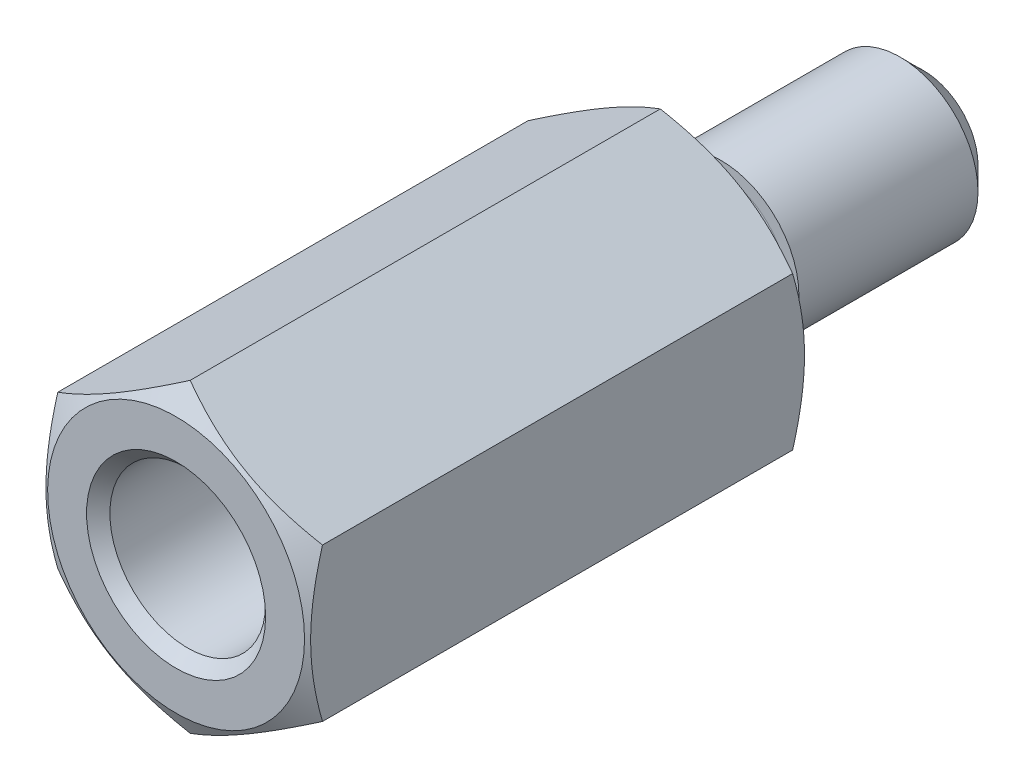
ISO-10303-21;
HEADER;
FILE_DESCRIPTION(('STEP AP214'),'2;1');
FILE_NAME('part.step','',(''),(''),'','','');
FILE_SCHEMA(('AUTOMOTIVE_DESIGN { 1 0 10303 214 1 1 1 1 }'));
ENDSEC;
DATA;
#1=APPLICATION_CONTEXT('core data for automotive mechanical design processes');
#2=APPLICATION_PROTOCOL_DEFINITION('international standard','automotive_design',2000,#1);
#3=PRODUCT_CONTEXT('',#1,'mechanical');
#4=PRODUCT('Part','Part','',(#3));
#5=PRODUCT_RELATED_PRODUCT_CATEGORY('part','',(#4));
#6=PRODUCT_DEFINITION_FORMATION('','',#4);
#7=PRODUCT_DEFINITION_CONTEXT('part definition',#1,'design');
#8=PRODUCT_DEFINITION('design','',#6,#7);
#9=PRODUCT_DEFINITION_SHAPE('','',#8);
#10=(LENGTH_UNIT() NAMED_UNIT(*) SI_UNIT(.MILLI.,.METRE.));
#11=(NAMED_UNIT(*) PLANE_ANGLE_UNIT() SI_UNIT($,.RADIAN.));
#12=(NAMED_UNIT(*) SI_UNIT($,.STERADIAN.) SOLID_ANGLE_UNIT());
#13=UNCERTAINTY_MEASURE_WITH_UNIT(LENGTH_MEASURE(1.E-05),#10,'distance_accuracy_value','');
#14=(GEOMETRIC_REPRESENTATION_CONTEXT(3) GLOBAL_UNCERTAINTY_ASSIGNED_CONTEXT((#13)) GLOBAL_UNIT_ASSIGNED_CONTEXT((#10,
#11,#12)) REPRESENTATION_CONTEXT('',''));
#15=CARTESIAN_POINT('',(0.,0.,0.));
#16=DIRECTION('',(0.,0.,1.));
#17=DIRECTION('',(1.,0.,0.));
#18=AXIS2_PLACEMENT_3D('',#15,#16,#17);
#19=CARTESIAN_POINT('',(8.5,4.90747728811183,0.));
#20=DIRECTION('',(0.,0.,-1.));
#21=DIRECTION('',(-1.,0.,0.));
#22=AXIS2_PLACEMENT_3D('',#19,#20,#21);
#23=PLANE('',#22);
#24=CARTESIAN_POINT('',(0.,0.,0.));
#25=DIRECTION('',(0.,0.,-1.));
#26=DIRECTION('',(-1.,0.,0.));
#27=AXIS2_PLACEMENT_3D('',#24,#25,#26);
#28=CIRCLE('',#27,4.25);
#29=CARTESIAN_POINT('',(-4.25,0.,0.));
#30=VERTEX_POINT('',#29);
#31=EDGE_CURVE('E9',#30,#30,#28,.F.);
#32=ORIENTED_EDGE('',*,*,#31,.T.);
#33=EDGE_LOOP('',(#32));
#34=FACE_BOUND('',#33,.T.);
#35=CARTESIAN_POINT('',(0.,0.,0.));
#36=DIRECTION('',(0.,0.,1.));
#37=DIRECTION('',(1.,0.,0.));
#38=AXIS2_PLACEMENT_3D('',#35,#36,#37);
#39=CIRCLE('',#38,8.25);
#40=CARTESIAN_POINT('',(8.25,0.,0.));
#41=VERTEX_POINT('',#40);
#42=EDGE_CURVE('E136',#41,#41,#39,.T.);
#43=ORIENTED_EDGE('',*,*,#42,.F.);
#44=EDGE_LOOP('',(#43));
#45=FACE_BOUND('',#44,.T.);
#46=ADVANCED_FACE('F14',(#34,#45),#23,.T.);
#47=CARTESIAN_POINT('',(0.,0.,42.756485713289));
#48=DIRECTION('',(0.,0.,1.));
#49=DIRECTION('',(1.,0.,0.));
#50=AXIS2_PLACEMENT_3D('',#47,#48,#49);
#51=CYLINDRICAL_SURFACE('',#50,3.85);
#52=CARTESIAN_POINT('',(0.,0.,-2.6));
#53=DIRECTION('',(0.,0.,-1.));
#54=DIRECTION('',(-1.,0.,0.));
#55=AXIS2_PLACEMENT_3D('',#52,#53,#54);
#56=CIRCLE('',#55,3.85);
#57=CARTESIAN_POINT('',(-3.85,0.,-2.6));
#58=VERTEX_POINT('',#57);
#59=EDGE_CURVE('E103',#58,#58,#56,.F.);
#60=ORIENTED_EDGE('',*,*,#59,.T.);
#61=EDGE_LOOP('',(#60));
#62=FACE_BOUND('',#61,.T.);
#63=CARTESIAN_POINT('',(0.,0.,-0.4));
#64=DIRECTION('',(0.,0.,-1.));
#65=DIRECTION('',(-1.,0.,0.));
#66=AXIS2_PLACEMENT_3D('',#63,#64,#65);
#67=CIRCLE('',#66,3.85);
#68=CARTESIAN_POINT('',(-3.85,0.,-0.4));
#69=VERTEX_POINT('',#68);
#70=EDGE_CURVE('E100',#69,#69,#67,.T.);
#71=ORIENTED_EDGE('',*,*,#70,.T.);
#72=EDGE_LOOP('',(#71));
#73=FACE_BOUND('',#72,.T.);
#74=ADVANCED_FACE('F120',(#62,#73),#51,.T.);
#75=CARTESIAN_POINT('',(0.,3.85,-3.));
#76=DIRECTION('',(0.,0.,-1.));
#77=DIRECTION('',(-1.,0.,0.));
#78=AXIS2_PLACEMENT_3D('',#75,#76,#77);
#79=PLANE('',#78);
#80=CARTESIAN_POINT('',(0.,0.,-3.));
#81=DIRECTION('',(0.,0.,-1.));
#82=DIRECTION('',(-1.,0.,0.));
#83=AXIS2_PLACEMENT_3D('',#80,#81,#82);
#84=CIRCLE('',#83,4.25);
#85=CARTESIAN_POINT('',(-4.25,0.,-3.));
#86=VERTEX_POINT('',#85);
#87=EDGE_CURVE('E24',#86,#86,#84,.T.);
#88=ORIENTED_EDGE('',*,*,#87,.T.);
#89=EDGE_LOOP('',(#88));
#90=FACE_BOUND('',#89,.T.);
#91=CARTESIAN_POINT('',(0.,0.,-3.));
#92=DIRECTION('',(0.,0.,1.));
#93=DIRECTION('',(1.,0.,0.));
#94=AXIS2_PLACEMENT_3D('',#91,#92,#93);
#95=CIRCLE('',#94,5.);
#96=CARTESIAN_POINT('',(5.,0.,-3.));
#97=VERTEX_POINT('',#96);
#98=EDGE_CURVE('E269',#97,#97,#95,.T.);
#99=ORIENTED_EDGE('',*,*,#98,.T.);
#100=EDGE_LOOP('',(#99));
#101=FACE_BOUND('',#100,.T.);
#102=ADVANCED_FACE('F109',(#90,#101),#79,.F.);
#103=CARTESIAN_POINT('',(0.,0.,42.756485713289));
#104=DIRECTION('',(0.,0.,1.));
#105=DIRECTION('',(1.,0.,0.));
#106=AXIS2_PLACEMENT_3D('',#103,#104,#105);
#107=CYLINDRICAL_SURFACE('',#106,5.);
#108=CARTESIAN_POINT('',(0.,0.,-14.5));
#109=DIRECTION('',(0.,0.,1.));
#110=DIRECTION('',(1.,0.,0.));
#111=AXIS2_PLACEMENT_3D('',#108,#109,#110);
#112=CIRCLE('',#111,5.);
#113=CARTESIAN_POINT('',(5.,0.,-14.5));
#114=VERTEX_POINT('',#113);
#115=EDGE_CURVE('E88',#114,#114,#112,.T.);
#116=ORIENTED_EDGE('',*,*,#115,.T.);
#117=EDGE_LOOP('',(#116));
#118=FACE_BOUND('',#117,.T.);
#119=ORIENTED_EDGE('',*,*,#98,.F.);
#120=EDGE_LOOP('',(#119));
#121=FACE_BOUND('',#120,.T.);
#122=ADVANCED_FACE('F392',(#118,#121),#107,.T.);
#123=CARTESIAN_POINT('',(0.,5.,-16.));
#124=DIRECTION('',(0.,0.,1.));
#125=DIRECTION('',(1.,0.,0.));
#126=AXIS2_PLACEMENT_3D('',#123,#124,#125);
#127=PLANE('',#126);
#128=CARTESIAN_POINT('',(0.,0.,-16.));
#129=DIRECTION('',(0.,0.,1.));
#130=DIRECTION('',(1.,0.,0.));
#131=AXIS2_PLACEMENT_3D('',#128,#129,#130);
#132=CIRCLE('',#131,3.5);
#133=CARTESIAN_POINT('',(3.5,0.,-16.));
#134=VERTEX_POINT('',#133);
#135=EDGE_CURVE('E92',#134,#134,#132,.F.);
#136=ORIENTED_EDGE('',*,*,#135,.T.);
#137=EDGE_LOOP('',(#136));
#138=FACE_BOUND('',#137,.T.);
#139=ADVANCED_FACE('F382',(#138),#127,.F.);
#140=CARTESIAN_POINT('',(0.,0.,-14.5));
#141=DIRECTION('',(0.,0.,1.));
#142=DIRECTION('',(1.,0.,0.));
#143=AXIS2_PLACEMENT_3D('',#140,#141,#142);
#144=CONICAL_SURFACE('',#143,5.,0.785398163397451);
#145=ORIENTED_EDGE('',*,*,#135,.F.);
#146=EDGE_LOOP('',(#145));
#147=FACE_BOUND('',#146,.T.);
#148=ORIENTED_EDGE('',*,*,#115,.F.);
#149=EDGE_LOOP('',(#148));
#150=FACE_BOUND('',#149,.T.);
#151=ADVANCED_FACE('F116',(#147,#150),#144,.T.);
#152=CARTESIAN_POINT('',(0.,0.,-2.6));
#153=DIRECTION('',(0.,0.,-1.));
#154=DIRECTION('',(-1.,0.,0.));
#155=AXIS2_PLACEMENT_3D('',#152,#153,#154);
#156=TOROIDAL_SURFACE('',#155,4.25,0.4);
#157=ORIENTED_EDGE('',*,*,#87,.F.);
#158=EDGE_LOOP('',(#157));
#159=FACE_BOUND('',#158,.T.);
#160=ORIENTED_EDGE('',*,*,#59,.F.);
#161=EDGE_LOOP('',(#160));
#162=FACE_BOUND('',#161,.T.);
#163=ADVANCED_FACE('F112',(#159,#162),#156,.F.);
#164=CARTESIAN_POINT('',(0.,0.,-0.4));
#165=DIRECTION('',(0.,0.,-1.));
#166=DIRECTION('',(-1.,0.,0.));
#167=AXIS2_PLACEMENT_3D('',#164,#165,#166);
#168=TOROIDAL_SURFACE('',#167,4.25,0.4);
#169=ORIENTED_EDGE('',*,*,#70,.F.);
#170=EDGE_LOOP('',(#169));
#171=FACE_BOUND('',#170,.T.);
#172=ORIENTED_EDGE('',*,*,#31,.F.);
#173=EDGE_LOOP('',(#172));
#174=FACE_BOUND('',#173,.T.);
#175=ADVANCED_FACE('F115',(#171,#174),#168,.F.);
#176=CARTESIAN_POINT('',(0.,0.,0.903526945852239));
#177=DIRECTION('',(0.,0.,1.));
#178=DIRECTION('',(1.,0.,0.));
#179=AXIS2_PLACEMENT_3D('',#176,#177,#178);
#180=CONICAL_SURFACE('',#179,9.81495457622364,1.04719755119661);
#181=ORIENTED_EDGE('',*,*,#42,.T.);
#182=EDGE_LOOP('',(#181));
#183=FACE_BOUND('',#182,.T.);
#184=CARTESIAN_POINT('',(-0.000199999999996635,9.81507004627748,0.903593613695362));
#185=CARTESIAN_POINT('',(0.186639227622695,9.70719836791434,0.841323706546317));
#186=CARTESIAN_POINT('',(0.374175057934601,9.59892450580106,0.781879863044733));
#187=CARTESIAN_POINT('',(0.750769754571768,9.38149745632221,0.669422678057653));
#188=CARTESIAN_POINT('',(0.939829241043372,9.27234391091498,0.616412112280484));
#189=CARTESIAN_POINT('',(1.5100347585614,8.94313560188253,0.468070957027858));
#190=CARTESIAN_POINT('',(1.89343164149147,8.72178130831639,0.383696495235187));
#191=CARTESIAN_POINT('',(2.46717766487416,8.39052888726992,0.284757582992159));
#192=CARTESIAN_POINT('',(2.65581276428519,8.28162036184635,0.256572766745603));
#193=CARTESIAN_POINT('',(3.03393602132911,8.06331079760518,0.209311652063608));
#194=CARTESIAN_POINT('',(3.22342410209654,7.95390980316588,0.190234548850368));
#195=CARTESIAN_POINT('',(3.6027265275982,7.73491944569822,0.161672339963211));
#196=CARTESIAN_POINT('',(3.79254025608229,7.62533043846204,0.15217634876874));
#197=CARTESIAN_POINT('',(4.17234305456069,7.40605119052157,0.142979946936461));
#198=CARTESIAN_POINT('',(4.36233211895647,7.29636095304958,0.143279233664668));
#199=CARTESIAN_POINT('',(4.71752301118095,7.09129139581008,0.152992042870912));
#200=CARTESIAN_POINT('',(4.8827499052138,6.99589760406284,0.161220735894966));
#201=CARTESIAN_POINT('',(5.21281671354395,6.80533344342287,0.184926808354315));
#202=CARTESIAN_POINT('',(5.37765660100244,6.71016309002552,0.200404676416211));
#203=CARTESIAN_POINT('',(5.87153810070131,6.4250204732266,0.257346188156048));
#204=CARTESIAN_POINT('',(6.19970550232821,6.23555293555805,0.309310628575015));
#205=CARTESIAN_POINT('',(6.85952142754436,5.85460803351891,0.439222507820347));
#206=CARTESIAN_POINT('',(7.19108574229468,5.66317928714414,0.51772063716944));
#207=CARTESIAN_POINT('',(7.84926989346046,5.28317649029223,0.695878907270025));
#208=CARTESIAN_POINT('',(8.17589815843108,5.0945975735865,0.79549720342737));
#209=CARTESIAN_POINT('',(8.5002,4.90736181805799,0.903593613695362));
#210=B_SPLINE_CURVE_WITH_KNOTS('',3,(#184,#185,#186,#187,#188,#189,#190,#191,#192,#193,#194,
#195,#196,#197,#198,#199,#200,#201,#202,#203,#204,#205,#206,#207,#208,#209),.UNSPECIFIED.,.F.,
.F.,(4,2,2,2,2,2,2,2,2,2,2,2,4),(0.,0.673596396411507,1.34748239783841,2.69805431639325,
3.35679995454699,4.01548737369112,4.67342558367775,5.33134346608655,5.90409556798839,
6.47688628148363,7.62328361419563,8.79510569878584,9.96462743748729),.UNSPECIFIED.);
#211=CARTESIAN_POINT('',(0.,9.81495457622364,0.903526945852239));
#212=VERTEX_POINT('',#211);
#213=CARTESIAN_POINT('',(8.5,4.90747728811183,0.903526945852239));
#214=VERTEX_POINT('',#213);
#215=EDGE_CURVE('E31',#212,#214,#210,.T.);
#216=ORIENTED_EDGE('',*,*,#215,.T.);
#217=CARTESIAN_POINT('',(8.5,-12.9953438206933,4.20214445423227));
#218=CARTESIAN_POINT('',(8.5,-12.6223011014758,4.02195280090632));
#219=CARTESIAN_POINT('',(8.5,-12.2483741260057,3.84355854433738));
#220=CARTESIAN_POINT('',(8.5,-11.4982734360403,3.49139239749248));
#221=CARTESIAN_POINT('',(8.5,-11.1220993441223,3.31762131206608));
#222=CARTESIAN_POINT('',(8.5,-10.3649842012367,2.97480925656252));
#223=CARTESIAN_POINT('',(8.5,-9.9840281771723,2.80580123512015));
#224=CARTESIAN_POINT('',(8.5,-9.2189776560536,2.47507337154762));
#225=CARTESIAN_POINT('',(8.5,-8.83488332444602,2.31335314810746));
#226=CARTESIAN_POINT('',(8.5,-8.05827000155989,1.99725792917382));
#227=CARTESIAN_POINT('',(8.5,-7.66570525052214,1.84299473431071));
#228=CARTESIAN_POINT('',(8.5,-6.87593938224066,1.54660014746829));
#229=CARTESIAN_POINT('',(8.5,-6.47873775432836,1.40447010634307));
#230=CARTESIAN_POINT('',(8.5,-5.67988381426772,1.13617601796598));
#231=CARTESIAN_POINT('',(8.5,-5.27824308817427,1.00997785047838));
#232=CARTESIAN_POINT('',(8.5,-4.46926711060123,0.777656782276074));
#233=CARTESIAN_POINT('',(8.5,-4.06193370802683,0.671527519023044));
#234=CARTESIAN_POINT('',(8.5,-3.24121808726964,0.484515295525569));
#235=CARTESIAN_POINT('',(8.5,-2.82783404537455,0.403640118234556));
#236=CARTESIAN_POINT('',(8.5,-2.20413783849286,0.305328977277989));
#237=CARTESIAN_POINT('',(8.5,-1.99561028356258,0.276390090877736));
#238=CARTESIAN_POINT('',(8.5,-1.57758365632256,0.226749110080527));
#239=CARTESIAN_POINT('',(8.5,-1.36808467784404,0.206046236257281));
#240=CARTESIAN_POINT('',(8.5,-0.949716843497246,0.173433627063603));
#241=CARTESIAN_POINT('',(8.5,-0.740852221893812,0.16146979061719));
#242=CARTESIAN_POINT('',(8.5,-0.32280433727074,0.146398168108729));
#243=CARTESIAN_POINT('',(8.5,-0.113621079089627,0.143290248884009));
#244=CARTESIAN_POINT('',(8.5,0.304629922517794,0.146004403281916));
#245=CARTESIAN_POINT('',(8.5,0.513697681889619,0.151823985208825));
#246=CARTESIAN_POINT('',(8.5,0.931406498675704,0.172248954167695));
#247=CARTESIAN_POINT('',(8.5,1.14004753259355,0.186854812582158));
#248=CARTESIAN_POINT('',(8.5,1.64621912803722,0.232643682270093));
#249=CARTESIAN_POINT('',(8.5,1.94335676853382,0.268255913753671));
#250=CARTESIAN_POINT('',(8.5,2.53529083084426,0.355313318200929));
#251=CARTESIAN_POINT('',(8.5,2.83008689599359,0.40676085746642));
#252=CARTESIAN_POINT('',(8.5,3.71148367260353,0.582274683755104));
#253=CARTESIAN_POINT('',(8.5,4.29393978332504,0.727394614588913));
#254=CARTESIAN_POINT('',(8.5,5.16515755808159,0.977457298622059));
#255=CARTESIAN_POINT('',(8.5,5.45847541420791,1.06742556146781));
#256=CARTESIAN_POINT('',(8.5,6.04227759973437,1.25629246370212));
#257=CARTESIAN_POINT('',(8.5,6.33276167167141,1.3551919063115));
#258=CARTESIAN_POINT('',(8.5,6.90944623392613,1.55980497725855));
#259=CARTESIAN_POINT('',(8.5,7.19566165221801,1.66547695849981));
#260=CARTESIAN_POINT('',(8.5,7.76565926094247,1.88291533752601));
#261=CARTESIAN_POINT('',(8.5,8.04944225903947,1.99467961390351));
#262=CARTESIAN_POINT('',(8.5,8.33220149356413,2.10891920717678));
#263=B_SPLINE_CURVE_WITH_KNOTS('',3,(#217,#218,#219,#220,#221,#222,#223,#224,#225,#226,#227,
#228,#229,#230,#231,#232,#233,#234,#235,#236,#237,#238,#239,#240,#241,#242,#243,#244,#245,#246,
#247,#248,#249,#250,#251,#252,#253,#254,#255,#256,#257,#258,#259,#260,#261,#262),.UNSPECIFIED.,
.F.,.F.,(4,2,2,2,2,2,2,2,2,2,2,2,2,2,2,2,2,2,2,2,2,2,4),(0.,1.24286396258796,2.48594289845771,
3.73617049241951,4.98633259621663,6.25153784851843,7.51688378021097,8.77947209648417,
10.0416594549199,11.3042354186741,11.93567629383,12.5670573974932,13.1944958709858,
13.8219249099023,14.4491788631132,15.0764664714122,15.9737486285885,16.8711649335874,
18.6694595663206,19.5898052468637,20.5102337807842,21.4254630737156,22.3403756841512),.UNSPECIFIED.);
#264=CARTESIAN_POINT('',(8.5,-4.90747728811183,0.903526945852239));
#265=VERTEX_POINT('',#264);
#266=EDGE_CURVE('E138',#214,#265,#263,.F.);
#267=ORIENTED_EDGE('',*,*,#266,.T.);
#268=CARTESIAN_POINT('',(8.5002,-4.90736181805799,0.90359361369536));
#269=CARTESIAN_POINT('',(8.31336077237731,-5.01523349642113,0.841323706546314));
#270=CARTESIAN_POINT('',(8.1258249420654,-5.12350735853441,0.781879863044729));
#271=CARTESIAN_POINT('',(7.74923024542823,-5.34093440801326,0.669422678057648));
#272=CARTESIAN_POINT('',(7.56017075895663,-5.45008795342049,0.616412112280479));
#273=CARTESIAN_POINT('',(6.9899652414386,-5.77929626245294,0.468070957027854));
#274=CARTESIAN_POINT('',(6.60656835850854,-6.00065055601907,0.383696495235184));
#275=CARTESIAN_POINT('',(6.03282233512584,-6.33190297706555,0.284757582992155));
#276=CARTESIAN_POINT('',(5.84418723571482,-6.44081150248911,0.256572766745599));
#277=CARTESIAN_POINT('',(5.46606397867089,-6.65912106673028,0.209311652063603));
#278=CARTESIAN_POINT('',(5.27657589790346,-6.76852206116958,0.190234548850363));
#279=CARTESIAN_POINT('',(4.8972734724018,-6.98751241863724,0.161672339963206));
#280=CARTESIAN_POINT('',(4.70745974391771,-7.09710142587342,0.152176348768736));
#281=CARTESIAN_POINT('',(4.32765694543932,-7.31638067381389,0.142979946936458));
#282=CARTESIAN_POINT('',(4.13766788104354,-7.42607091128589,0.143279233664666));
#283=CARTESIAN_POINT('',(3.78247698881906,-7.63114046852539,0.15299204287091));
#284=CARTESIAN_POINT('',(3.61725009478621,-7.72653426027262,0.161220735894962));
#285=CARTESIAN_POINT('',(3.28718328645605,-7.9170984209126,0.184926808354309));
#286=CARTESIAN_POINT('',(3.12234339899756,-8.01226877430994,0.200404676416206));
#287=CARTESIAN_POINT('',(2.62846189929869,-8.29741139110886,0.257346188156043));
#288=CARTESIAN_POINT('',(2.30029449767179,-8.48687892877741,0.309310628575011));
#289=CARTESIAN_POINT('',(1.64047857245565,-8.86782383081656,0.439222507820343));
#290=CARTESIAN_POINT('',(1.30891425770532,-9.05925257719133,0.517720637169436));
#291=CARTESIAN_POINT('',(0.650730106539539,-9.43925537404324,0.695878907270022));
#292=CARTESIAN_POINT('',(0.324101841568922,-9.62783429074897,0.795497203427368));
#293=CARTESIAN_POINT('',(-0.000199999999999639,-9.81507004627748,0.90359361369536));
#294=B_SPLINE_CURVE_WITH_KNOTS('',3,(#268,#269,#270,#271,#272,#273,#274,#275,#276,#277,#278,
#279,#280,#281,#282,#283,#284,#285,#286,#287,#288,#289,#290,#291,#292,#293),.UNSPECIFIED.,.F.,
.F.,(4,2,2,2,2,2,2,2,2,2,2,2,4),(0.,0.673596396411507,1.34748239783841,2.69805431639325,
3.35679995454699,4.01548737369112,4.67342558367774,5.33134346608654,5.90409556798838,
6.47688628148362,7.62328361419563,8.79510569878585,9.96462743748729),.UNSPECIFIED.);
#295=CARTESIAN_POINT('',(0.,-9.81495457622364,0.903526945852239));
#296=VERTEX_POINT('',#295);
#297=EDGE_CURVE('E140',#265,#296,#294,.T.);
#298=ORIENTED_EDGE('',*,*,#297,.T.);
#299=CARTESIAN_POINT('',(0.00019999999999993,-9.81507004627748,0.90359361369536));
#300=CARTESIAN_POINT('',(-0.186639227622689,-9.70719836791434,0.841323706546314));
#301=CARTESIAN_POINT('',(-0.374175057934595,-9.59892450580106,0.78187986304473));
#302=CARTESIAN_POINT('',(-0.75076975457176,-9.3814974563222,0.669422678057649));
#303=CARTESIAN_POINT('',(-0.939829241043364,-9.27234391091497,0.61641211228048));
#304=CARTESIAN_POINT('',(-1.51003475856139,-8.94313560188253,0.468070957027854));
#305=CARTESIAN_POINT('',(-1.89343164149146,-8.72178130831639,0.383696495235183));
#306=CARTESIAN_POINT('',(-2.46717766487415,-8.39052888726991,0.284757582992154));
#307=CARTESIAN_POINT('',(-2.65581276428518,-8.28162036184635,0.256572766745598));
#308=CARTESIAN_POINT('',(-3.0339360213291,-8.06331079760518,0.209311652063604));
#309=CARTESIAN_POINT('',(-3.22342410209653,-7.95390980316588,0.190234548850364));
#310=CARTESIAN_POINT('',(-3.60272652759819,-7.73491944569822,0.161672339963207));
#311=CARTESIAN_POINT('',(-3.79254025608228,-7.62533043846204,0.152176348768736));
#312=CARTESIAN_POINT('',(-4.17234305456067,-7.40605119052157,0.142979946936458));
#313=CARTESIAN_POINT('',(-4.36233211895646,-7.29636095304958,0.143279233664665));
#314=CARTESIAN_POINT('',(-4.71752301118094,-7.09129139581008,0.152992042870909));
#315=CARTESIAN_POINT('',(-4.88274990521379,-6.99589760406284,0.161220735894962));
#316=CARTESIAN_POINT('',(-5.21281671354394,-6.80533344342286,0.184926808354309));
#317=CARTESIAN_POINT('',(-5.37765660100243,-6.71016309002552,0.200404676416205));
#318=CARTESIAN_POINT('',(-5.8715381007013,-6.4250204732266,0.257346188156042));
#319=CARTESIAN_POINT('',(-6.1997055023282,-6.23555293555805,0.30931062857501));
#320=CARTESIAN_POINT('',(-6.85952142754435,-5.8546080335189,0.439222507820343));
#321=CARTESIAN_POINT('',(-7.19108574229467,-5.66317928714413,0.517720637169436));
#322=CARTESIAN_POINT('',(-7.84926989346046,-5.28317649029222,0.695878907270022));
#323=CARTESIAN_POINT('',(-8.17589815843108,-5.09459757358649,0.795497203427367));
#324=CARTESIAN_POINT('',(-8.5002,-4.90736181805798,0.90359361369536));
#325=B_SPLINE_CURVE_WITH_KNOTS('',3,(#299,#300,#301,#302,#303,#304,#305,#306,#307,#308,#309,
#310,#311,#312,#313,#314,#315,#316,#317,#318,#319,#320,#321,#322,#323,#324),.UNSPECIFIED.,.F.,
.F.,(4,2,2,2,2,2,2,2,2,2,2,2,4),(0.,0.673596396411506,1.34748239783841,2.69805431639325,
3.35679995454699,4.01548737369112,4.67342558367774,5.33134346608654,5.90409556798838,
6.47688628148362,7.62328361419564,8.79510569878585,9.9646274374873),.UNSPECIFIED.);
#326=CARTESIAN_POINT('',(-8.5,-4.90747728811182,0.903526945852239));
#327=VERTEX_POINT('',#326);
#328=EDGE_CURVE('E237',#296,#327,#325,.T.);
#329=ORIENTED_EDGE('',*,*,#328,.T.);
#330=CARTESIAN_POINT('',(-8.5,-12.9953438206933,4.20214445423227));
#331=CARTESIAN_POINT('',(-8.5,-12.6223011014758,4.02195280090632));
#332=CARTESIAN_POINT('',(-8.5,-12.2483741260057,3.84355854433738));
#333=CARTESIAN_POINT('',(-8.5,-11.4982734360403,3.49139239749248));
#334=CARTESIAN_POINT('',(-8.5,-11.1220993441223,3.31762131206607));
#335=CARTESIAN_POINT('',(-8.5,-10.3649842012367,2.97480925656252));
#336=CARTESIAN_POINT('',(-8.5,-9.98402817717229,2.80580123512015));
#337=CARTESIAN_POINT('',(-8.5,-9.21897765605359,2.47507337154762));
#338=CARTESIAN_POINT('',(-8.5,-8.83488332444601,2.31335314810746));
#339=CARTESIAN_POINT('',(-8.5,-8.05827000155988,1.99725792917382));
#340=CARTESIAN_POINT('',(-8.5,-7.66570525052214,1.8429947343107));
#341=CARTESIAN_POINT('',(-8.5,-6.87593938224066,1.54660014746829));
#342=CARTESIAN_POINT('',(-8.5,-6.47873775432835,1.40447010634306));
#343=CARTESIAN_POINT('',(-8.5,-5.67988381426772,1.13617601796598));
#344=CARTESIAN_POINT('',(-8.5,-5.27824308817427,1.00997785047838));
#345=CARTESIAN_POINT('',(-8.5,-4.46926711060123,0.777656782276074));
#346=CARTESIAN_POINT('',(-8.5,-4.06193370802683,0.671527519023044));
#347=CARTESIAN_POINT('',(-8.5,-3.24121808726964,0.48451529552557));
#348=CARTESIAN_POINT('',(-8.5,-2.82783404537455,0.403640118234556));
#349=CARTESIAN_POINT('',(-8.5,-2.20413783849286,0.305328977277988));
#350=CARTESIAN_POINT('',(-8.5,-1.99561028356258,0.276390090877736));
#351=CARTESIAN_POINT('',(-8.5,-1.57758365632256,0.226749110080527));
#352=CARTESIAN_POINT('',(-8.5,-1.36808467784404,0.206046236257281));
#353=CARTESIAN_POINT('',(-8.5,-0.949716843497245,0.173433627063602));
#354=CARTESIAN_POINT('',(-8.5,-0.74085222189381,0.16146979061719));
#355=CARTESIAN_POINT('',(-8.5,-0.322804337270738,0.146398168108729));
#356=CARTESIAN_POINT('',(-8.5,-0.113621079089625,0.143290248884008));
#357=CARTESIAN_POINT('',(-8.5,0.304629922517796,0.146004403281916));
#358=CARTESIAN_POINT('',(-8.5,0.513697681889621,0.151823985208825));
#359=CARTESIAN_POINT('',(-8.5,0.931406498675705,0.172248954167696));
#360=CARTESIAN_POINT('',(-8.5,1.14004753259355,0.186854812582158));
#361=CARTESIAN_POINT('',(-8.5,1.64621912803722,0.232643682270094));
#362=CARTESIAN_POINT('',(-8.5,1.94335676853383,0.268255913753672));
#363=CARTESIAN_POINT('',(-8.5,2.53529083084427,0.355313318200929));
#364=CARTESIAN_POINT('',(-8.5,2.83008689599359,0.406760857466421));
#365=CARTESIAN_POINT('',(-8.5,3.71148367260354,0.582274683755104));
#366=CARTESIAN_POINT('',(-8.5,4.29393978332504,0.727394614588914));
#367=CARTESIAN_POINT('',(-8.5,5.1651575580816,0.977457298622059));
#368=CARTESIAN_POINT('',(-8.5,5.45847541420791,1.06742556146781));
#369=CARTESIAN_POINT('',(-8.5,6.04227759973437,1.25629246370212));
#370=CARTESIAN_POINT('',(-8.5,6.33276167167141,1.35519190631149));
#371=CARTESIAN_POINT('',(-8.5,6.90944623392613,1.55980497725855));
#372=CARTESIAN_POINT('',(-8.5,7.19566165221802,1.66547695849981));
#373=CARTESIAN_POINT('',(-8.5,7.76565926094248,1.88291533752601));
#374=CARTESIAN_POINT('',(-8.5,8.04944225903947,1.99467961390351));
#375=CARTESIAN_POINT('',(-8.5,8.33220149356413,2.10891920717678));
#376=B_SPLINE_CURVE_WITH_KNOTS('',3,(#330,#331,#332,#333,#334,#335,#336,#337,#338,#339,#340,
#341,#342,#343,#344,#345,#346,#347,#348,#349,#350,#351,#352,#353,#354,#355,#356,#357,#358,#359,
#360,#361,#362,#363,#364,#365,#366,#367,#368,#369,#370,#371,#372,#373,#374,#375),.UNSPECIFIED.,
.F.,.F.,(4,2,2,2,2,2,2,2,2,2,2,2,2,2,2,2,2,2,2,2,2,2,4),(0.,1.24286396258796,2.48594289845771,
3.73617049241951,4.98633259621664,6.25153784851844,7.51688378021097,8.77947209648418,
10.0416594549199,11.3042354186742,11.93567629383,12.5670573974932,13.1944958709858,
13.8219249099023,14.4491788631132,15.0764664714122,15.9737486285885,16.8711649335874,
18.6694595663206,19.5898052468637,20.5102337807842,21.4254630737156,22.3403756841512),.UNSPECIFIED.);
#377=CARTESIAN_POINT('',(-8.5,4.90747728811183,0.903526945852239));
#378=VERTEX_POINT('',#377);
#379=EDGE_CURVE('E70',#327,#378,#376,.T.);
#380=ORIENTED_EDGE('',*,*,#379,.T.);
#381=CARTESIAN_POINT('',(-8.5002,4.90736181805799,0.903593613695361));
#382=CARTESIAN_POINT('',(-8.31336077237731,5.01523349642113,0.841323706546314));
#383=CARTESIAN_POINT('',(-8.1258249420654,5.12350735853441,0.781879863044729));
#384=CARTESIAN_POINT('',(-7.74923024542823,5.34093440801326,0.669422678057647));
#385=CARTESIAN_POINT('',(-7.56017075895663,5.45008795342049,0.616412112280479));
#386=CARTESIAN_POINT('',(-6.9899652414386,5.77929626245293,0.468070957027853));
#387=CARTESIAN_POINT('',(-6.60656835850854,6.00065055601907,0.383696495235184));
#388=CARTESIAN_POINT('',(-6.03282233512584,6.33190297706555,0.284757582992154));
#389=CARTESIAN_POINT('',(-5.84418723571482,6.44081150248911,0.256572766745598));
#390=CARTESIAN_POINT('',(-5.46606397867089,6.65912106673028,0.209311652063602));
#391=CARTESIAN_POINT('',(-5.27657589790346,6.76852206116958,0.190234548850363));
#392=CARTESIAN_POINT('',(-4.8972734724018,6.98751241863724,0.161672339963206));
#393=CARTESIAN_POINT('',(-4.70745974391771,7.09710142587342,0.152176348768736));
#394=CARTESIAN_POINT('',(-4.32765694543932,7.31638067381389,0.142979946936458));
#395=CARTESIAN_POINT('',(-4.13766788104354,7.42607091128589,0.143279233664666));
#396=CARTESIAN_POINT('',(-3.78247698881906,7.63114046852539,0.15299204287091));
#397=CARTESIAN_POINT('',(-3.61725009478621,7.72653426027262,0.161220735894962));
#398=CARTESIAN_POINT('',(-3.28718328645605,7.91709842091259,0.184926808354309));
#399=CARTESIAN_POINT('',(-3.12234339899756,8.01226877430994,0.200404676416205));
#400=CARTESIAN_POINT('',(-2.62846189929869,8.29741139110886,0.257346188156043));
#401=CARTESIAN_POINT('',(-2.30029449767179,8.48687892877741,0.30931062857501));
#402=CARTESIAN_POINT('',(-1.64047857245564,8.86782383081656,0.439222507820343));
#403=CARTESIAN_POINT('',(-1.30891425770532,9.05925257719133,0.517720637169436));
#404=CARTESIAN_POINT('',(-0.650730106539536,9.43925537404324,0.695878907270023));
#405=CARTESIAN_POINT('',(-0.324101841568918,9.62783429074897,0.795497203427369));
#406=CARTESIAN_POINT('',(0.000200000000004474,9.81507004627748,0.903593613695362));
#407=B_SPLINE_CURVE_WITH_KNOTS('',3,(#381,#382,#383,#384,#385,#386,#387,#388,#389,#390,#391,
#392,#393,#394,#395,#396,#397,#398,#399,#400,#401,#402,#403,#404,#405,#406),.UNSPECIFIED.,.F.,
.F.,(4,2,2,2,2,2,2,2,2,2,2,2,4),(0.,0.673596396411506,1.34748239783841,2.69805431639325,
3.35679995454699,4.01548737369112,4.67342558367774,5.33134346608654,5.90409556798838,
6.47688628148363,7.62328361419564,8.79510569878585,9.9646274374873),.UNSPECIFIED.);
#408=EDGE_CURVE('E67',#378,#212,#407,.T.);
#409=ORIENTED_EDGE('',*,*,#408,.T.);
#410=EDGE_LOOP('',(#216,#267,#298,#329,#380,#409));
#411=FACE_BOUND('',#410,.T.);
#412=ADVANCED_FACE('F68',(#183,#411),#180,.T.);
#413=CARTESIAN_POINT('',(0.,0.,32.));
#414=DIRECTION('',(0.,0.,1.));
#415=DIRECTION('',(1.,0.,0.));
#416=AXIS2_PLACEMENT_3D('',#413,#414,#415);
#417=CONICAL_SURFACE('',#416,5.75,0.785398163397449);
#418=CARTESIAN_POINT('',(0.,0.,31.25));
#419=DIRECTION('',(0.,0.,1.));
#420=DIRECTION('',(1.,0.,0.));
#421=AXIS2_PLACEMENT_3D('',#418,#419,#420);
#422=CIRCLE('',#421,5.);
#423=CARTESIAN_POINT('',(5.,0.,31.25));
#424=VERTEX_POINT('',#423);
#425=EDGE_CURVE('E19',#424,#424,#422,.F.);
#426=ORIENTED_EDGE('',*,*,#425,.T.);
#427=EDGE_LOOP('',(#426));
#428=FACE_BOUND('',#427,.T.);
#429=CARTESIAN_POINT('',(0.,0.,32.));
#430=DIRECTION('',(0.,0.,1.));
#431=DIRECTION('',(1.,0.,0.));
#432=AXIS2_PLACEMENT_3D('',#429,#430,#431);
#433=CIRCLE('',#432,5.75);
#434=CARTESIAN_POINT('',(5.75,0.,32.));
#435=VERTEX_POINT('',#434);
#436=EDGE_CURVE('E271',#435,#435,#433,.T.);
#437=ORIENTED_EDGE('',*,*,#436,.T.);
#438=EDGE_LOOP('',(#437));
#439=FACE_BOUND('',#438,.T.);
#440=ADVANCED_FACE('F189',(#428,#439),#417,.F.);
#441=CARTESIAN_POINT('',(8.5,4.90747728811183,32.));
#442=DIRECTION('',(0.,0.,-1.));
#443=DIRECTION('',(-1.,0.,0.));
#444=AXIS2_PLACEMENT_3D('',#441,#442,#443);
#445=PLANE('',#444);
#446=ORIENTED_EDGE('',*,*,#436,.F.);
#447=EDGE_LOOP('',(#446));
#448=FACE_BOUND('',#447,.T.);
#449=CARTESIAN_POINT('',(0.,0.,32.));
#450=DIRECTION('',(0.,0.,1.));
#451=DIRECTION('',(1.,0.,0.));
#452=AXIS2_PLACEMENT_3D('',#449,#450,#451);
#453=CIRCLE('',#452,8.25);
#454=CARTESIAN_POINT('',(8.25,0.,32.));
#455=VERTEX_POINT('',#454);
#456=EDGE_CURVE('E83',#455,#455,#453,.T.);
#457=ORIENTED_EDGE('',*,*,#456,.T.);
#458=EDGE_LOOP('',(#457));
#459=FACE_BOUND('',#458,.T.);
#460=ADVANCED_FACE('F168',(#448,#459),#445,.F.);
#461=CARTESIAN_POINT('',(0.,0.,32.));
#462=DIRECTION('',(0.,0.,-1.));
#463=DIRECTION('',(-1.,0.,0.));
#464=AXIS2_PLACEMENT_3D('',#461,#462,#463);
#465=CONICAL_SURFACE('',#464,8.25,1.0471975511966);
#466=ORIENTED_EDGE('',*,*,#456,.F.);
#467=EDGE_LOOP('',(#466));
#468=FACE_BOUND('',#467,.T.);
#469=CARTESIAN_POINT('',(8.5002,4.90736181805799,31.0964063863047));
#470=CARTESIAN_POINT('',(8.31336077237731,5.01523349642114,31.1586762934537));
#471=CARTESIAN_POINT('',(8.1258249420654,5.12350735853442,31.2181201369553));
#472=CARTESIAN_POINT('',(7.74923024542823,5.34093440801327,31.3305773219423));
#473=CARTESIAN_POINT('',(7.56017075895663,5.4500879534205,31.3835878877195));
#474=CARTESIAN_POINT('',(6.9899652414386,5.77929626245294,31.5319290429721));
#475=CARTESIAN_POINT('',(6.60656835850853,6.00065055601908,31.6163035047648));
#476=CARTESIAN_POINT('',(6.03282233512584,6.33190297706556,31.7152424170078));
#477=CARTESIAN_POINT('',(5.84418723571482,6.44081150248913,31.7434272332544));
#478=CARTESIAN_POINT('',(5.46606397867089,6.65912106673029,31.7906883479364));
#479=CARTESIAN_POINT('',(5.27657589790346,6.7685220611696,31.8097654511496));
#480=CARTESIAN_POINT('',(4.8972734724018,6.98751241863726,31.8383276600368));
#481=CARTESIAN_POINT('',(4.70745974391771,7.09710142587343,31.8478236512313));
#482=CARTESIAN_POINT('',(4.32765694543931,7.31638067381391,31.8570200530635));
#483=CARTESIAN_POINT('',(4.13766788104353,7.4260709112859,31.8567207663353));
#484=CARTESIAN_POINT('',(3.78247698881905,7.6311404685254,31.8470079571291));
#485=CARTESIAN_POINT('',(3.6172500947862,7.72653426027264,31.838779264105));
#486=CARTESIAN_POINT('',(3.28718328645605,7.91709842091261,31.8150731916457));
#487=CARTESIAN_POINT('',(3.12234339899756,8.01226877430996,31.7995953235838));
#488=CARTESIAN_POINT('',(2.62846189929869,8.29741139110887,31.742653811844));
#489=CARTESIAN_POINT('',(2.30029449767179,8.48687892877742,31.690689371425));
#490=CARTESIAN_POINT('',(1.64047857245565,8.86782383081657,31.5607774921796));
#491=CARTESIAN_POINT('',(1.30891425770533,9.05925257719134,31.4822793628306));
#492=CARTESIAN_POINT('',(0.650730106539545,9.43925537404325,31.30412109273));
#493=CARTESIAN_POINT('',(0.324101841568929,9.62783429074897,31.2045027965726));
#494=CARTESIAN_POINT('',(-0.000199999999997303,9.81507004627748,31.0964063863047));
#495=B_SPLINE_CURVE_WITH_KNOTS('',3,(#469,#470,#471,#472,#473,#474,#475,#476,#477,#478,#479,
#480,#481,#482,#483,#484,#485,#486,#487,#488,#489,#490,#491,#492,#493,#494),.UNSPECIFIED.,.F.,
.F.,(4,2,2,2,2,2,2,2,2,2,2,2,4),(0.,0.673596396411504,1.34748239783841,2.69805431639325,
3.35679995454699,4.01548737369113,4.67342558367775,5.33134346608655,5.90409556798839,
6.47688628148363,7.62328361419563,8.79510569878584,9.96462743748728),.UNSPECIFIED.);
#496=CARTESIAN_POINT('',(8.5,4.90747728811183,31.0964730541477));
#497=VERTEX_POINT('',#496);
#498=CARTESIAN_POINT('',(0.,9.81495457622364,31.0964730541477));
#499=VERTEX_POINT('',#498);
#500=EDGE_CURVE('E213',#497,#499,#495,.T.);
#501=ORIENTED_EDGE('',*,*,#500,.T.);
#502=CARTESIAN_POINT('',(0.000200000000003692,9.81507004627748,31.0964063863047));
#503=CARTESIAN_POINT('',(-0.186639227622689,9.70719836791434,31.1586762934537));
#504=CARTESIAN_POINT('',(-0.374175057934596,9.59892450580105,31.2181201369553));
#505=CARTESIAN_POINT('',(-0.750769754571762,9.3814974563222,31.3305773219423));
#506=CARTESIAN_POINT('',(-0.939829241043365,9.27234391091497,31.3835878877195));
#507=CARTESIAN_POINT('',(-1.51003475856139,8.94313560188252,31.5319290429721));
#508=CARTESIAN_POINT('',(-1.89343164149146,8.72178130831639,31.6163035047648));
#509=CARTESIAN_POINT('',(-2.46717766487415,8.39052888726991,31.7152424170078));
#510=CARTESIAN_POINT('',(-2.65581276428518,8.28162036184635,31.7434272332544));
#511=CARTESIAN_POINT('',(-3.0339360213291,8.06331079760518,31.7906883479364));
#512=CARTESIAN_POINT('',(-3.22342410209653,7.95390980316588,31.8097654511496));
#513=CARTESIAN_POINT('',(-3.60272652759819,7.73491944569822,31.8383276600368));
#514=CARTESIAN_POINT('',(-3.79254025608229,7.62533043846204,31.8478236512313));
#515=CARTESIAN_POINT('',(-4.17234305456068,7.40605119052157,31.8570200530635));
#516=CARTESIAN_POINT('',(-4.36233211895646,7.29636095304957,31.8567207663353));
#517=CARTESIAN_POINT('',(-4.71752301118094,7.09129139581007,31.8470079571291));
#518=CARTESIAN_POINT('',(-4.88274990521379,6.99589760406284,31.838779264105));
#519=CARTESIAN_POINT('',(-5.21281671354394,6.80533344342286,31.8150731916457));
#520=CARTESIAN_POINT('',(-5.37765660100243,6.71016309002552,31.7995953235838));
#521=CARTESIAN_POINT('',(-5.8715381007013,6.4250204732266,31.742653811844));
#522=CARTESIAN_POINT('',(-6.1997055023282,6.23555293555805,31.690689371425));
#523=CARTESIAN_POINT('',(-6.85952142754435,5.8546080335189,31.5607774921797));
#524=CARTESIAN_POINT('',(-7.19108574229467,5.66317928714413,31.4822793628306));
#525=CARTESIAN_POINT('',(-7.84926989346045,5.28317649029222,31.30412109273));
#526=CARTESIAN_POINT('',(-8.17589815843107,5.0945975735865,31.2045027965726));
#527=CARTESIAN_POINT('',(-8.5002,4.90736181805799,31.0964063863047));
#528=B_SPLINE_CURVE_WITH_KNOTS('',3,(#502,#503,#504,#505,#506,#507,#508,#509,#510,#511,#512,
#513,#514,#515,#516,#517,#518,#519,#520,#521,#522,#523,#524,#525,#526,#527),.UNSPECIFIED.,.F.,
.F.,(4,2,2,2,2,2,2,2,2,2,2,2,4),(0.,0.673596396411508,1.34748239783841,2.69805431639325,
3.35679995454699,4.01548737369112,4.67342558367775,5.33134346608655,5.90409556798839,
6.47688628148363,7.62328361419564,8.79510569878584,9.96462743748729),.UNSPECIFIED.);
#529=CARTESIAN_POINT('',(-8.5,4.90747728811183,31.0964730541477));
#530=VERTEX_POINT('',#529);
#531=EDGE_CURVE('E87',#499,#530,#528,.T.);
#532=ORIENTED_EDGE('',*,*,#531,.T.);
#533=CARTESIAN_POINT('',(-8.5,-12.9953438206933,27.7978555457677));
#534=CARTESIAN_POINT('',(-8.5,-12.6223011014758,27.9780471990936));
#535=CARTESIAN_POINT('',(-8.5,-12.2483741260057,28.1564414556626));
#536=CARTESIAN_POINT('',(-8.5,-11.4982734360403,28.5086076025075));
#537=CARTESIAN_POINT('',(-8.5,-11.1220993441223,28.6823786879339));
#538=CARTESIAN_POINT('',(-8.5,-10.3649842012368,29.0251907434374));
#539=CARTESIAN_POINT('',(-8.5,-9.98402817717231,29.1941987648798));
#540=CARTESIAN_POINT('',(-8.5,-9.21897765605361,29.5249266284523));
#541=CARTESIAN_POINT('',(-8.5,-8.83488332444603,29.6866468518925));
#542=CARTESIAN_POINT('',(-8.5,-8.0582700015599,30.0027420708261));
#543=CARTESIAN_POINT('',(-8.5,-7.66570525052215,30.1570052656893));
#544=CARTESIAN_POINT('',(-8.5,-6.87593938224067,30.4533998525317));
#545=CARTESIAN_POINT('',(-8.5,-6.47873775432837,30.5955298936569));
#546=CARTESIAN_POINT('',(-8.5,-5.67988381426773,30.863823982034));
#547=CARTESIAN_POINT('',(-8.5,-5.27824308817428,30.9900221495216));
#548=CARTESIAN_POINT('',(-8.5,-4.46926711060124,31.2223432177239));
#549=CARTESIAN_POINT('',(-8.5,-4.06193370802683,31.3284724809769));
#550=CARTESIAN_POINT('',(-8.5,-3.24121808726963,31.5154847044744));
#551=CARTESIAN_POINT('',(-8.5,-2.82783404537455,31.5963598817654));
#552=CARTESIAN_POINT('',(-8.5,-2.20413783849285,31.694671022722));
#553=CARTESIAN_POINT('',(-8.5,-1.99561028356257,31.7236099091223));
#554=CARTESIAN_POINT('',(-8.5,-1.57758365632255,31.7732508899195));
#555=CARTESIAN_POINT('',(-8.5,-1.36808467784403,31.7939537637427));
#556=CARTESIAN_POINT('',(-8.5,-0.949716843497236,31.8265663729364));
#557=CARTESIAN_POINT('',(-8.5,-0.740852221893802,31.8385302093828));
#558=CARTESIAN_POINT('',(-8.5,-0.322804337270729,31.8536018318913));
#559=CARTESIAN_POINT('',(-8.5,-0.113621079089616,31.856709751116));
#560=CARTESIAN_POINT('',(-8.5,0.304629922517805,31.8539955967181));
#561=CARTESIAN_POINT('',(-8.5,0.51369768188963,31.8481760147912));
#562=CARTESIAN_POINT('',(-8.5,0.931406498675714,31.8277510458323));
#563=CARTESIAN_POINT('',(-8.5,1.14004753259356,31.8131451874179));
#564=CARTESIAN_POINT('',(-8.5,1.64621912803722,31.7673563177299));
#565=CARTESIAN_POINT('',(-8.5,1.94335676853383,31.7317440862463));
#566=CARTESIAN_POINT('',(-8.5,2.53529083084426,31.6446866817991));
#567=CARTESIAN_POINT('',(-8.5,2.83008689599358,31.5932391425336));
#568=CARTESIAN_POINT('',(-8.5,3.71148367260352,31.4177253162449));
#569=CARTESIAN_POINT('',(-8.5,4.29393978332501,31.2726053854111));
#570=CARTESIAN_POINT('',(-8.5,5.16515755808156,31.0225427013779));
#571=CARTESIAN_POINT('',(-8.5,5.45847541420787,30.9325744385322));
#572=CARTESIAN_POINT('',(-8.5,6.04227759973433,30.7437075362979));
#573=CARTESIAN_POINT('',(-8.5,6.33276167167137,30.6448080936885));
#574=CARTESIAN_POINT('',(-8.5,6.90944623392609,30.4401950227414));
#575=CARTESIAN_POINT('',(-8.5,7.19566165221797,30.3345230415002));
#576=CARTESIAN_POINT('',(-8.5,7.76565926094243,30.117084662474));
#577=CARTESIAN_POINT('',(-8.5,8.04944225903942,30.0053203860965));
#578=CARTESIAN_POINT('',(-8.5,8.33220149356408,29.8910807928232));
#579=B_SPLINE_CURVE_WITH_KNOTS('',3,(#533,#534,#535,#536,#537,#538,#539,#540,#541,#542,#543,
#544,#545,#546,#547,#548,#549,#550,#551,#552,#553,#554,#555,#556,#557,#558,#559,#560,#561,#562,
#563,#564,#565,#566,#567,#568,#569,#570,#571,#572,#573,#574,#575,#576,#577,#578),.UNSPECIFIED.,
.F.,.F.,(4,2,2,2,2,2,2,2,2,2,2,2,2,2,2,2,2,2,2,2,2,2,4),(0.,1.24286396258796,2.48594289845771,
3.73617049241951,4.98633259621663,6.25153784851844,7.51688378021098,8.77947209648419,
10.0416594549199,11.3042354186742,11.93567629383,12.5670573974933,13.1944958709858,
13.8219249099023,14.4491788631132,15.0764664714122,15.9737486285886,16.8711649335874,
18.6694595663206,19.5898052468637,20.5102337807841,21.4254630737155,22.3403756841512),.UNSPECIFIED.);
#580=CARTESIAN_POINT('',(-8.5,-4.90747728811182,31.0964730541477));
#581=VERTEX_POINT('',#580);
#582=EDGE_CURVE('E202',#530,#581,#579,.F.);
#583=ORIENTED_EDGE('',*,*,#582,.T.);
#584=CARTESIAN_POINT('',(-8.5002,-4.90736181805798,31.0964063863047));
#585=CARTESIAN_POINT('',(-8.31336077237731,-5.01523349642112,31.1586762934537));
#586=CARTESIAN_POINT('',(-8.1258249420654,-5.1235073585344,31.2181201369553));
#587=CARTESIAN_POINT('',(-7.74923024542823,-5.34093440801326,31.3305773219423));
#588=CARTESIAN_POINT('',(-7.56017075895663,-5.45008795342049,31.3835878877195));
#589=CARTESIAN_POINT('',(-6.9899652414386,-5.77929626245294,31.5319290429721));
#590=CARTESIAN_POINT('',(-6.60656835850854,-6.00065055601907,31.6163035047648));
#591=CARTESIAN_POINT('',(-6.03282233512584,-6.33190297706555,31.7152424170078));
#592=CARTESIAN_POINT('',(-5.84418723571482,-6.44081150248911,31.7434272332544));
#593=CARTESIAN_POINT('',(-5.46606397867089,-6.65912106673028,31.7906883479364));
#594=CARTESIAN_POINT('',(-5.27657589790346,-6.76852206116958,31.8097654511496));
#595=CARTESIAN_POINT('',(-4.8972734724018,-6.98751241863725,31.8383276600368));
#596=CARTESIAN_POINT('',(-4.70745974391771,-7.09710142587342,31.8478236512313));
#597=CARTESIAN_POINT('',(-4.32765694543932,-7.3163806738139,31.8570200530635));
#598=CARTESIAN_POINT('',(-4.13766788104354,-7.42607091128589,31.8567207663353));
#599=CARTESIAN_POINT('',(-3.78247698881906,-7.63114046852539,31.8470079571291));
#600=CARTESIAN_POINT('',(-3.6172500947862,-7.72653426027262,31.838779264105));
#601=CARTESIAN_POINT('',(-3.28718328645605,-7.9170984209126,31.8150731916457));
#602=CARTESIAN_POINT('',(-3.12234339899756,-8.01226877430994,31.7995953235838));
#603=CARTESIAN_POINT('',(-2.62846189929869,-8.29741139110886,31.7426538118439));
#604=CARTESIAN_POINT('',(-2.30029449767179,-8.48687892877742,31.690689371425));
#605=CARTESIAN_POINT('',(-1.64047857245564,-8.86782383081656,31.5607774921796));
#606=CARTESIAN_POINT('',(-1.30891425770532,-9.05925257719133,31.4822793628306));
#607=CARTESIAN_POINT('',(-0.650730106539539,-9.43925537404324,31.30412109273));
#608=CARTESIAN_POINT('',(-0.324101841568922,-9.62783429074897,31.2045027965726));
#609=CARTESIAN_POINT('',(0.000200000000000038,-9.81507004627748,31.0964063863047));
#610=B_SPLINE_CURVE_WITH_KNOTS('',3,(#584,#585,#586,#587,#588,#589,#590,#591,#592,#593,#594,
#595,#596,#597,#598,#599,#600,#601,#602,#603,#604,#605,#606,#607,#608,#609),.UNSPECIFIED.,.F.,
.F.,(4,2,2,2,2,2,2,2,2,2,2,2,4),(0.,0.673596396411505,1.34748239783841,2.69805431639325,
3.35679995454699,4.01548737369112,4.67342558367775,5.33134346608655,5.90409556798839,
6.47688628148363,7.62328361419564,8.79510569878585,9.96462743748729),.UNSPECIFIED.);
#611=CARTESIAN_POINT('',(0.,-9.81495457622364,31.0964730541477));
#612=VERTEX_POINT('',#611);
#613=EDGE_CURVE('E196',#581,#612,#610,.T.);
#614=ORIENTED_EDGE('',*,*,#613,.T.);
#615=CARTESIAN_POINT('',(-0.000200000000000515,-9.81507004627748,31.0964063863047));
#616=CARTESIAN_POINT('',(0.186639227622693,-9.70719836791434,31.1586762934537));
#617=CARTESIAN_POINT('',(0.3741750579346,-9.59892450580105,31.2181201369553));
#618=CARTESIAN_POINT('',(0.750769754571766,-9.3814974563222,31.3305773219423));
#619=CARTESIAN_POINT('',(0.939829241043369,-9.27234391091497,31.3835878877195));
#620=CARTESIAN_POINT('',(1.5100347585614,-8.94313560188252,31.5319290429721));
#621=CARTESIAN_POINT('',(1.89343164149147,-8.72178130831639,31.6163035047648));
#622=CARTESIAN_POINT('',(2.46717766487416,-8.39052888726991,31.7152424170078));
#623=CARTESIAN_POINT('',(2.65581276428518,-8.28162036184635,31.7434272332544));
#624=CARTESIAN_POINT('',(3.03393602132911,-8.06331079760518,31.7906883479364));
#625=CARTESIAN_POINT('',(3.22342410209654,-7.95390980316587,31.8097654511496));
#626=CARTESIAN_POINT('',(3.6027265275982,-7.73491944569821,31.8383276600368));
#627=CARTESIAN_POINT('',(3.79254025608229,-7.62533043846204,31.8478236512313));
#628=CARTESIAN_POINT('',(4.17234305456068,-7.40605119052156,31.8570200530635));
#629=CARTESIAN_POINT('',(4.36233211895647,-7.29636095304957,31.8567207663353));
#630=CARTESIAN_POINT('',(4.71752301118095,-7.09129139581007,31.8470079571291));
#631=CARTESIAN_POINT('',(4.8827499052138,-6.99589760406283,31.838779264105));
#632=CARTESIAN_POINT('',(5.21281671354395,-6.80533344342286,31.8150731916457));
#633=CARTESIAN_POINT('',(5.37765660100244,-6.71016309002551,31.7995953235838));
#634=CARTESIAN_POINT('',(5.87153810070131,-6.42502047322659,31.7426538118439));
#635=CARTESIAN_POINT('',(6.19970550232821,-6.23555293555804,31.690689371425));
#636=CARTESIAN_POINT('',(6.85952142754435,-5.8546080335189,31.5607774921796));
#637=CARTESIAN_POINT('',(7.19108574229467,-5.66317928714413,31.4822793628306));
#638=CARTESIAN_POINT('',(7.84926989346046,-5.28317649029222,31.30412109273));
#639=CARTESIAN_POINT('',(8.17589815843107,-5.0945975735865,31.2045027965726));
#640=CARTESIAN_POINT('',(8.5002,-4.90736181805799,31.0964063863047));
#641=B_SPLINE_CURVE_WITH_KNOTS('',3,(#615,#616,#617,#618,#619,#620,#621,#622,#623,#624,#625,
#626,#627,#628,#629,#630,#631,#632,#633,#634,#635,#636,#637,#638,#639,#640),.UNSPECIFIED.,.F.,
.F.,(4,2,2,2,2,2,2,2,2,2,2,2,4),(0.,0.673596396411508,1.34748239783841,2.69805431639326,
3.35679995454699,4.01548737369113,4.67342558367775,5.33134346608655,5.90409556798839,
6.47688628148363,7.62328361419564,8.79510569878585,9.96462743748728),.UNSPECIFIED.);
#642=CARTESIAN_POINT('',(8.5,-4.90747728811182,31.0964730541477));
#643=VERTEX_POINT('',#642);
#644=EDGE_CURVE('E39',#612,#643,#641,.T.);
#645=ORIENTED_EDGE('',*,*,#644,.T.);
#646=CARTESIAN_POINT('',(8.5,-12.9953438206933,27.7978555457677));
#647=CARTESIAN_POINT('',(8.5,-12.6223011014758,27.9780471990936));
#648=CARTESIAN_POINT('',(8.5,-12.2483741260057,28.1564414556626));
#649=CARTESIAN_POINT('',(8.5,-11.4982734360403,28.5086076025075));
#650=CARTESIAN_POINT('',(8.5,-11.1220993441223,28.6823786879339));
#651=CARTESIAN_POINT('',(8.5,-10.3649842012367,29.0251907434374));
#652=CARTESIAN_POINT('',(8.5,-9.98402817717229,29.1941987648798));
#653=CARTESIAN_POINT('',(8.5,-9.21897765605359,29.5249266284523));
#654=CARTESIAN_POINT('',(8.5,-8.83488332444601,29.6866468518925));
#655=CARTESIAN_POINT('',(8.5,-8.05827000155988,30.0027420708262));
#656=CARTESIAN_POINT('',(8.5,-7.66570525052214,30.1570052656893));
#657=CARTESIAN_POINT('',(8.5,-6.87593938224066,30.4533998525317));
#658=CARTESIAN_POINT('',(8.5,-6.47873775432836,30.5955298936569));
#659=CARTESIAN_POINT('',(8.5,-5.67988381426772,30.863823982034));
#660=CARTESIAN_POINT('',(8.5,-5.27824308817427,30.9900221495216));
#661=CARTESIAN_POINT('',(8.5,-4.46926711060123,31.2223432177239));
#662=CARTESIAN_POINT('',(8.5,-4.06193370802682,31.3284724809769));
#663=CARTESIAN_POINT('',(8.5,-3.24121808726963,31.5154847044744));
#664=CARTESIAN_POINT('',(8.5,-2.82783404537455,31.5963598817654));
#665=CARTESIAN_POINT('',(8.5,-2.20413783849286,31.694671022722));
#666=CARTESIAN_POINT('',(8.5,-1.99561028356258,31.7236099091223));
#667=CARTESIAN_POINT('',(8.5,-1.57758365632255,31.7732508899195));
#668=CARTESIAN_POINT('',(8.5,-1.36808467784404,31.7939537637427));
#669=CARTESIAN_POINT('',(8.5,-0.949716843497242,31.8265663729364));
#670=CARTESIAN_POINT('',(8.5,-0.740852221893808,31.8385302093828));
#671=CARTESIAN_POINT('',(8.5,-0.322804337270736,31.8536018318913));
#672=CARTESIAN_POINT('',(8.5,-0.113621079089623,31.856709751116));
#673=CARTESIAN_POINT('',(8.5,0.304629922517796,31.8539955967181));
#674=CARTESIAN_POINT('',(8.5,0.513697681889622,31.8481760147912));
#675=CARTESIAN_POINT('',(8.5,0.931406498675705,31.8277510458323));
#676=CARTESIAN_POINT('',(8.5,1.14004753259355,31.8131451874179));
#677=CARTESIAN_POINT('',(8.5,1.64621912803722,31.7673563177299));
#678=CARTESIAN_POINT('',(8.5,1.94335676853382,31.7317440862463));
#679=CARTESIAN_POINT('',(8.5,2.53529083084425,31.6446866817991));
#680=CARTESIAN_POINT('',(8.5,2.83008689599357,31.5932391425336));
#681=CARTESIAN_POINT('',(8.5,3.7114836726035,31.4177253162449));
#682=CARTESIAN_POINT('',(8.5,4.293939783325,31.2726053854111));
#683=CARTESIAN_POINT('',(8.5,5.16515755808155,31.0225427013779));
#684=CARTESIAN_POINT('',(8.5,5.45847541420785,30.9325744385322));
#685=CARTESIAN_POINT('',(8.5,6.04227759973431,30.7437075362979));
#686=CARTESIAN_POINT('',(8.5,6.33276167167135,30.6448080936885));
#687=CARTESIAN_POINT('',(8.5,6.90944623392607,30.4401950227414));
#688=CARTESIAN_POINT('',(8.5,7.19566165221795,30.3345230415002));
#689=CARTESIAN_POINT('',(8.5,7.7656592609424,30.117084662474));
#690=CARTESIAN_POINT('',(8.5,8.04944225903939,30.0053203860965));
#691=CARTESIAN_POINT('',(8.5,8.33220149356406,29.8910807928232));
#692=B_SPLINE_CURVE_WITH_KNOTS('',3,(#646,#647,#648,#649,#650,#651,#652,#653,#654,#655,#656,
#657,#658,#659,#660,#661,#662,#663,#664,#665,#666,#667,#668,#669,#670,#671,#672,#673,#674,#675,
#676,#677,#678,#679,#680,#681,#682,#683,#684,#685,#686,#687,#688,#689,#690,#691),.UNSPECIFIED.,
.F.,.F.,(4,2,2,2,2,2,2,2,2,2,2,2,2,2,2,2,2,2,2,2,2,2,4),(0.,1.24286396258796,2.48594289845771,
3.73617049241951,4.98633259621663,6.25153784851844,7.51688378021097,8.77947209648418,
10.0416594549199,11.3042354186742,11.93567629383,12.5670573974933,13.1944958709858,
13.8219249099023,14.4491788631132,15.0764664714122,15.9737486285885,16.8711649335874,
18.6694595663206,19.5898052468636,20.5102337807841,21.4254630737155,22.3403756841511),.UNSPECIFIED.);
#693=EDGE_CURVE('E173',#643,#497,#692,.T.);
#694=ORIENTED_EDGE('',*,*,#693,.T.);
#695=EDGE_LOOP('',(#501,#532,#583,#614,#645,#694));
#696=FACE_BOUND('',#695,.T.);
#697=ADVANCED_FACE('F166',(#468,#696),#465,.T.);
#698=CARTESIAN_POINT('',(8.5,-4.90747728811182,32.));
#699=DIRECTION('',(-1.,0.,0.));
#700=DIRECTION('',(0.,-1.,0.));
#701=AXIS2_PLACEMENT_3D('',#698,#699,#700);
#702=PLANE('',#701);
#703=ORIENTED_EDGE('',*,*,#266,.F.);
#704=DIRECTION('',(0.,0.,-1.));
#705=VECTOR('',#704,1.);
#706=CARTESIAN_POINT('',(8.5,4.90747728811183,32.));
#707=LINE('',#706,#705);
#708=EDGE_CURVE('E82',#497,#214,#707,.T.);
#709=ORIENTED_EDGE('',*,*,#708,.F.);
#710=ORIENTED_EDGE('',*,*,#693,.F.);
#711=DIRECTION('',(0.,0.,-1.));
#712=VECTOR('',#711,1.);
#713=CARTESIAN_POINT('',(8.5,-4.90747728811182,32.));
#714=LINE('',#713,#712);
#715=EDGE_CURVE('E264',#643,#265,#714,.T.);
#716=ORIENTED_EDGE('',*,*,#715,.T.);
#717=EDGE_LOOP('',(#703,#709,#710,#716));
#718=FACE_BOUND('',#717,.T.);
#719=ADVANCED_FACE('F161',(#718),#702,.F.);
#720=CARTESIAN_POINT('',(0.,-9.81495457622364,32.));
#721=DIRECTION('',(-0.5,0.866025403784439,0.));
#722=DIRECTION('',(-0.866025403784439,-0.5,0.));
#723=AXIS2_PLACEMENT_3D('',#720,#721,#722);
#724=PLANE('',#723);
#725=ORIENTED_EDGE('',*,*,#297,.F.);
#726=ORIENTED_EDGE('',*,*,#715,.F.);
#727=ORIENTED_EDGE('',*,*,#644,.F.);
#728=DIRECTION('',(0.,0.,-1.));
#729=VECTOR('',#728,1.);
#730=CARTESIAN_POINT('',(0.,-9.81495457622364,32.));
#731=LINE('',#730,#729);
#732=EDGE_CURVE('E259',#612,#296,#731,.T.);
#733=ORIENTED_EDGE('',*,*,#732,.T.);
#734=EDGE_LOOP('',(#725,#726,#727,#733));
#735=FACE_BOUND('',#734,.T.);
#736=ADVANCED_FACE('F165',(#735),#724,.F.);
#737=CARTESIAN_POINT('',(-8.5,-4.90747728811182,32.));
#738=DIRECTION('',(0.5,0.866025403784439,0.));
#739=DIRECTION('',(-0.866025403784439,0.5,0.));
#740=AXIS2_PLACEMENT_3D('',#737,#738,#739);
#741=PLANE('',#740);
#742=ORIENTED_EDGE('',*,*,#328,.F.);
#743=ORIENTED_EDGE('',*,*,#732,.F.);
#744=ORIENTED_EDGE('',*,*,#613,.F.);
#745=DIRECTION('',(0.,0.,-1.));
#746=VECTOR('',#745,1.);
#747=CARTESIAN_POINT('',(-8.5,-4.90747728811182,32.));
#748=LINE('',#747,#746);
#749=EDGE_CURVE('E94',#581,#327,#748,.T.);
#750=ORIENTED_EDGE('',*,*,#749,.T.);
#751=EDGE_LOOP('',(#742,#743,#744,#750));
#752=FACE_BOUND('',#751,.T.);
#753=ADVANCED_FACE('F242',(#752),#741,.F.);
#754=CARTESIAN_POINT('',(-8.5,4.90747728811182,32.));
#755=DIRECTION('',(1.,0.,0.));
#756=DIRECTION('',(0.,0.,-1.));
#757=AXIS2_PLACEMENT_3D('',#754,#755,#756);
#758=PLANE('',#757);
#759=ORIENTED_EDGE('',*,*,#379,.F.);
#760=ORIENTED_EDGE('',*,*,#749,.F.);
#761=ORIENTED_EDGE('',*,*,#582,.F.);
#762=DIRECTION('',(0.,0.,-1.));
#763=VECTOR('',#762,1.);
#764=CARTESIAN_POINT('',(-8.5,4.90747728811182,32.));
#765=LINE('',#764,#763);
#766=EDGE_CURVE('E89',#530,#378,#765,.T.);
#767=ORIENTED_EDGE('',*,*,#766,.T.);
#768=EDGE_LOOP('',(#759,#760,#761,#767));
#769=FACE_BOUND('',#768,.T.);
#770=ADVANCED_FACE('F221',(#769),#758,.F.);
#771=CARTESIAN_POINT('',(0.,9.81495457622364,32.));
#772=DIRECTION('',(0.5,-0.866025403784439,0.));
#773=DIRECTION('',(0.866025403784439,0.5,0.));
#774=AXIS2_PLACEMENT_3D('',#771,#772,#773);
#775=PLANE('',#774);
#776=ORIENTED_EDGE('',*,*,#408,.F.);
#777=ORIENTED_EDGE('',*,*,#766,.F.);
#778=ORIENTED_EDGE('',*,*,#531,.F.);
#779=DIRECTION('',(0.,0.,-1.));
#780=VECTOR('',#779,1.);
#781=CARTESIAN_POINT('',(0.,9.81495457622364,32.));
#782=LINE('',#781,#780);
#783=EDGE_CURVE('E80',#499,#212,#782,.T.);
#784=ORIENTED_EDGE('',*,*,#783,.T.);
#785=EDGE_LOOP('',(#776,#777,#778,#784));
#786=FACE_BOUND('',#785,.T.);
#787=ADVANCED_FACE('F86',(#786),#775,.F.);
#788=CARTESIAN_POINT('',(8.5,4.90747728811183,32.));
#789=DIRECTION('',(-0.5,-0.866025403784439,0.));
#790=DIRECTION('',(0.866025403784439,-0.5,0.));
#791=AXIS2_PLACEMENT_3D('',#788,#789,#790);
#792=PLANE('',#791);
#793=ORIENTED_EDGE('',*,*,#215,.F.);
#794=ORIENTED_EDGE('',*,*,#783,.F.);
#795=ORIENTED_EDGE('',*,*,#500,.F.);
#796=ORIENTED_EDGE('',*,*,#708,.T.);
#797=EDGE_LOOP('',(#793,#794,#795,#796));
#798=FACE_BOUND('',#797,.T.);
#799=ADVANCED_FACE('F16',(#798),#792,.F.);
#800=CARTESIAN_POINT('',(0.,0.,12.));
#801=DIRECTION('',(0.,0.,1.));
#802=DIRECTION('',(1.,0.,0.));
#803=AXIS2_PLACEMENT_3D('',#800,#801,#802);
#804=PLANE('',#803);
#805=CARTESIAN_POINT('',(0.,0.,12.));
#806=DIRECTION('',(0.,0.,1.));
#807=DIRECTION('',(1.,0.,0.));
#808=AXIS2_PLACEMENT_3D('',#805,#806,#807);
#809=CIRCLE('',#808,5.);
#810=CARTESIAN_POINT('',(5.,0.,12.));
#811=VERTEX_POINT('',#810);
#812=EDGE_CURVE('E143',#811,#811,#809,.T.);
#813=ORIENTED_EDGE('',*,*,#812,.T.);
#814=EDGE_LOOP('',(#813));
#815=FACE_BOUND('',#814,.T.);
#816=ADVANCED_FACE('F292',(#815),#804,.T.);
#817=CARTESIAN_POINT('',(0.,0.,12.));
#818=DIRECTION('',(0.,0.,1.));
#819=DIRECTION('',(1.,0.,0.));
#820=AXIS2_PLACEMENT_3D('',#817,#818,#819);
#821=CYLINDRICAL_SURFACE('',#820,5.);
#822=ORIENTED_EDGE('',*,*,#812,.F.);
#823=EDGE_LOOP('',(#822));
#824=FACE_BOUND('',#823,.T.);
#825=ORIENTED_EDGE('',*,*,#425,.F.);
#826=EDGE_LOOP('',(#825));
#827=FACE_BOUND('',#826,.T.);
#828=ADVANCED_FACE('F290',(#824,#827),#821,.F.);
#829=CLOSED_SHELL('',(#46,#74,#102,#122,#139,#151,#163,#175,#412,#440,#460,#697,#719,#736,#753,
#770,#787,#799,#816,#828));
#830=MANIFOLD_SOLID_BREP('B1',#829);
#831=ADVANCED_BREP_SHAPE_REPRESENTATION('',(#18,#830),#14);
#832=SHAPE_DEFINITION_REPRESENTATION(#9,#831);
ENDSEC;
END-ISO-10303-21;
